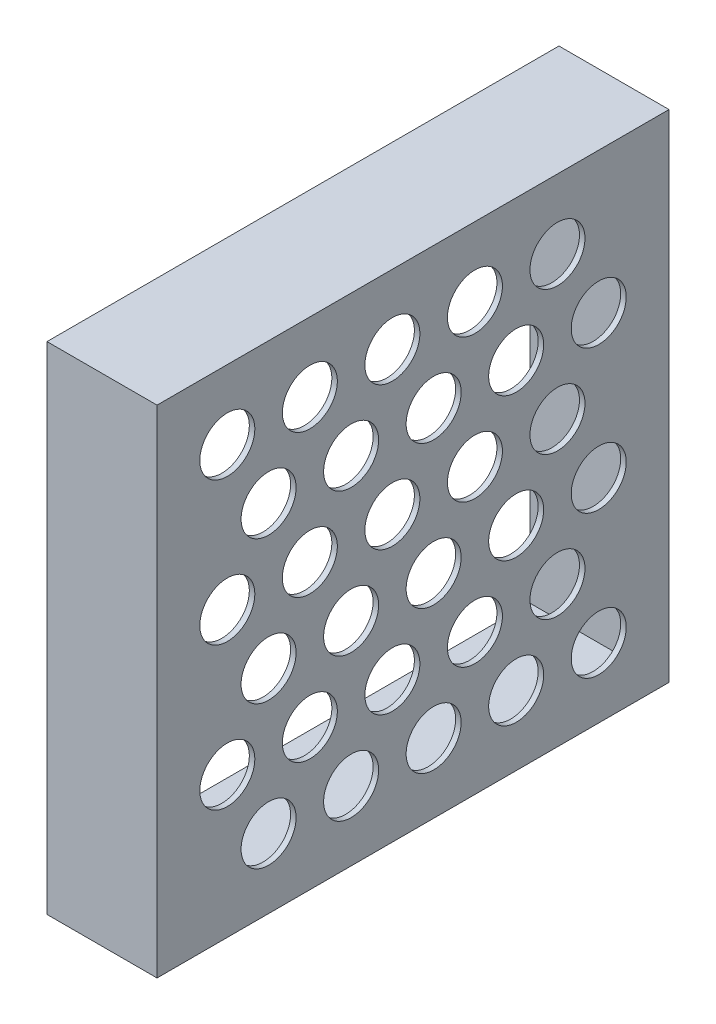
from build123d import *

# Parameters (mm, degrees)
SKETCH2_W           = 412.5
SKETCH2_H           = 399.751905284
SKETCH2_R           = 25
BOSS_EXTRUDE1_DEPTH = 5
SCALE1_SCALE        = 0.5
SKETCH6_W           = 232.617086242
SKETCH6_H           = 225.428178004
SKETCH6_W_2         = 206.25
SKETCH6_H_2         = 199.875952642
BOSS_EXTRUDE7_DEPTH = 50


with BuildPart() as part:
    # Sketch2 → Boss-Extrude1 (new body)
    with BuildSketch(Plane(origin=(0, 0, 0), x_dir=(0, 0, -1), z_dir=(1, 0, 0))):
        with Locations((168.75, 97.424047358)):
            Rectangle(SKETCH2_W, SKETCH2_H)
        Circle(SKETCH2_R, mode=Mode.SUBTRACT)
        with Locations((75, 0)):
            Circle(SKETCH2_R, mode=Mode.SUBTRACT)
        with Locations((150, 0)):
            Circle(SKETCH2_R, mode=Mode.SUBTRACT)
        with Locations((225, 0)):
            Circle(SKETCH2_R, mode=Mode.SUBTRACT)
        with Locations((300, 0)):
            Circle(SKETCH2_R, mode=Mode.SUBTRACT)
        with Locations((37.5, -64.951905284)):
            Circle(SKETCH2_R, mode=Mode.SUBTRACT)
        with Locations((112.5, -64.951905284)):
            Circle(SKETCH2_R, mode=Mode.SUBTRACT)
        with Locations((187.5, -64.951905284)):
            Circle(SKETCH2_R, mode=Mode.SUBTRACT)
        with Locations((262.5, -64.951905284)):
            Circle(SKETCH2_R, mode=Mode.SUBTRACT)
        with Locations((337.5, -64.951905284)):
            Circle(SKETCH2_R, mode=Mode.SUBTRACT)
        with Locations((37.5, 64.948094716)):
            Circle(SKETCH2_R, mode=Mode.SUBTRACT)
        with Locations((112.5, 64.948094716)):
            Circle(SKETCH2_R, mode=Mode.SUBTRACT)
        with Locations((187.5, 64.948094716)):
            Circle(SKETCH2_R, mode=Mode.SUBTRACT)
        with Locations((262.5, 64.948094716)):
            Circle(SKETCH2_R, mode=Mode.SUBTRACT)
        with Locations((337.5, 64.948094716)):
            Circle(SKETCH2_R, mode=Mode.SUBTRACT)
        with Locations((37.5, 194.848094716)):
            Circle(SKETCH2_R, mode=Mode.SUBTRACT)
        with Locations((112.5, 194.848094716)):
            Circle(SKETCH2_R, mode=Mode.SUBTRACT)
        with Locations((187.5, 194.848094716)):
            Circle(SKETCH2_R, mode=Mode.SUBTRACT)
        with Locations((262.5, 194.848094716)):
            Circle(SKETCH2_R, mode=Mode.SUBTRACT)
        with Locations((337.5, 194.848094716)):
            Circle(SKETCH2_R, mode=Mode.SUBTRACT)
        with Locations((0, 129.9)):
            Circle(SKETCH2_R, mode=Mode.SUBTRACT)
        with Locations((75, 129.9)):
            Circle(SKETCH2_R, mode=Mode.SUBTRACT)
        with Locations((150, 129.9)):
            Circle(SKETCH2_R, mode=Mode.SUBTRACT)
        with Locations((225, 129.9)):
            Circle(SKETCH2_R, mode=Mode.SUBTRACT)
        with Locations((300, 129.9)):
            Circle(SKETCH2_R, mode=Mode.SUBTRACT)
        with Locations((0, 259.8)):
            Circle(SKETCH2_R, mode=Mode.SUBTRACT)
        with Locations((75, 259.8)):
            Circle(SKETCH2_R, mode=Mode.SUBTRACT)
        with Locations((150, 259.8)):
            Circle(SKETCH2_R, mode=Mode.SUBTRACT)
        with Locations((225, 259.8)):
            Circle(SKETCH2_R, mode=Mode.SUBTRACT)
        with Locations((300, 259.8)):
            Circle(SKETCH2_R, mode=Mode.SUBTRACT)
    extrude(amount=BOSS_EXTRUDE1_DEPTH)


with BuildPart() as part_1:
    # Scale1: scaled about (2.5, 97.424047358, -168.75)
    add(part.part.scale(SCALE1_SCALE).moved(Location((1.25, 48.712023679, -84.375))))

    # Sketch6 → Boss-Extrude7 (add)
    with BuildSketch(Plane(origin=(3.75, 0, 0), x_dir=(0, 0, -1), z_dir=(1, 0, 0))):
        with Locations((168.75, 97.424047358)):
            Rectangle(SKETCH6_W, SKETCH6_H)
        with Locations((168.75, 97.424047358)):
            Rectangle(SKETCH6_W_2, SKETCH6_H_2, mode=Mode.SUBTRACT)
    extrude(amount=-BOSS_EXTRUDE7_DEPTH)


solid = part_1.part
